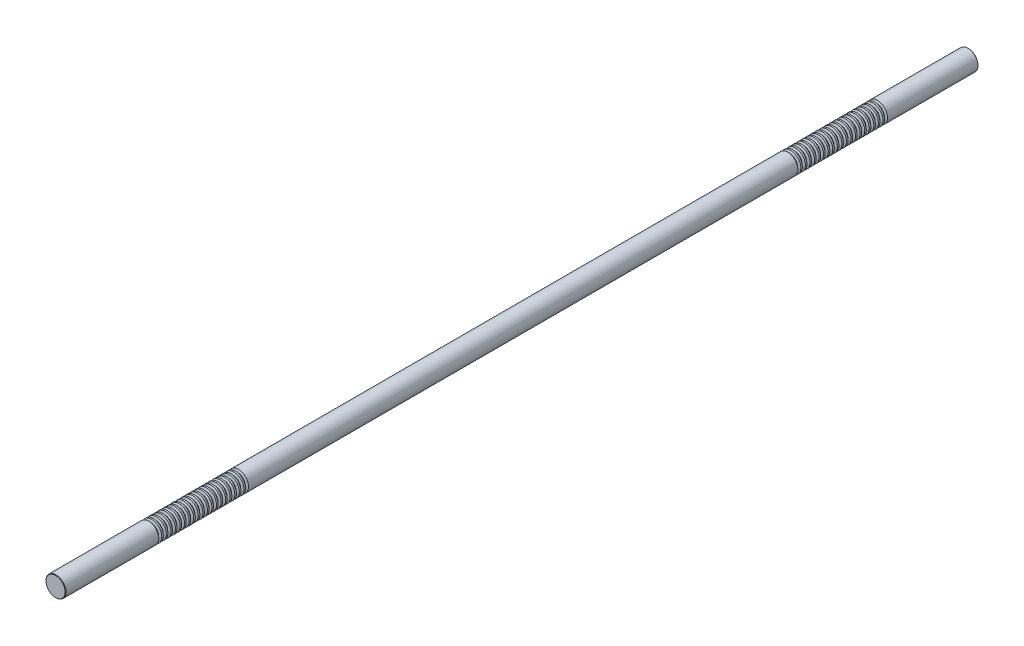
from build123d import *

# Parameters (mm, degrees)
SKETCH1_R           = 11
BOSS_EXTRUDE1_DEPTH = 500
CHAMFER1_SIZE       = 0.55
LPATTERN1_COUNT     = 20
LPATTERN1_PITCH     = 5
LPATTERN2_COUNT     = 2
LPATTERN2_PITCH     = 700


with BuildPart() as part:
    # Sketch1 → Boss-Extrude1 (new, symmetric)
    with BuildSketch(Plane.XY):
        Circle(SKETCH1_R)
    extrude(amount=BOSS_EXTRUDE1_DEPTH, both=True)

    # Chamfer1
    chamfer1_edges = [part.edges().sort_by_distance(p)[0] for p in [
        (-11, 0, -500),
        (-11, 0, 500),
    ]]
    chamfer(chamfer1_edges, length=CHAMFER1_SIZE)

    # Sketch2 → Cut-Revolve1 (revolve, cut)
    with BuildSketch(Plane(origin=(0, 0, 0), x_dir=(0, 0, -1), z_dir=(1, 0, 0)), mode=Mode.PRIVATE) as cut_revolve1_sk:
        Polygon((400.36843014, 11), (397.13156986, 11), (397.86843014, 8.25), (399.63156986, 8.25), align=None)
    cut_revolve1 = revolve(cut_revolve1_sk.sketch.rotate(Axis((0, 0, 500), (0, 0, -1)), 90), axis=Axis((0, 0, 500), (0, 0, -1)), mode=Mode.SUBTRACT)

    # LPattern1: Cut-Revolve1 ×20
    with Locations(*[(0, 0, i * LPATTERN1_PITCH) for i in range(1, LPATTERN1_COUNT)]):
        add(cut_revolve1, mode=Mode.SUBTRACT)

    # LPattern2: Cut-Revolve1 ×2
    with Locations(*[(0, 0, i * LPATTERN2_PITCH) for i in range(1, LPATTERN2_COUNT)]):
        add(cut_revolve1, mode=Mode.SUBTRACT)

    # LPattern2 copy 1 sketch → LPattern2 copy 1 (revolve, cut)
    with BuildSketch(Plane(origin=(0, 0, 705), x_dir=(0, 0, -1), z_dir=(1, 0, 0))):
        Polygon((400.36843014, 11), (397.13156986, 11), (397.86843014, 8.25), (399.63156986, 8.25), align=None)
    revolve(axis=Axis((0, 0, 1205), (0, 0, -1)), mode=Mode.SUBTRACT)

    # LPattern2 copy 2 sketch → LPattern2 copy 2 (revolve, cut)
    with BuildSketch(Plane(origin=(0, 0, 710), x_dir=(0, 0, -1), z_dir=(1, 0, 0))):
        Polygon((400.36843014, 11), (397.13156986, 11), (397.86843014, 8.25), (399.63156986, 8.25), align=None)
    revolve(axis=Axis((0, 0, 1210), (0, 0, -1)), mode=Mode.SUBTRACT)

    # LPattern2 copy 3 sketch → LPattern2 copy 3 (revolve, cut)
    with BuildSketch(Plane(origin=(0, 0, 715), x_dir=(0, 0, -1), z_dir=(1, 0, 0))):
        Polygon((400.36843014, 11), (397.13156986, 11), (397.86843014, 8.25), (399.63156986, 8.25), align=None)
    revolve(axis=Axis((0, 0, 1215), (0, 0, -1)), mode=Mode.SUBTRACT)

    # LPattern2 copy 4 sketch → LPattern2 copy 4 (revolve, cut)
    with BuildSketch(Plane(origin=(0, 0, 720), x_dir=(0, 0, -1), z_dir=(1, 0, 0))):
        Polygon((400.36843014, 11), (397.13156986, 11), (397.86843014, 8.25), (399.63156986, 8.25), align=None)
    revolve(axis=Axis((0, 0, 1220), (0, 0, -1)), mode=Mode.SUBTRACT)

    # LPattern2 copy 5 sketch → LPattern2 copy 5 (revolve, cut)
    with BuildSketch(Plane(origin=(0, 0, 725), x_dir=(0, 0, -1), z_dir=(1, 0, 0))):
        Polygon((400.36843014, 11), (397.13156986, 11), (397.86843014, 8.25), (399.63156986, 8.25), align=None)
    revolve(axis=Axis((0, 0, 1225), (0, 0, -1)), mode=Mode.SUBTRACT)

    # LPattern2 copy 6 sketch → LPattern2 copy 6 (revolve, cut)
    with BuildSketch(Plane(origin=(0, 0, 730), x_dir=(0, 0, -1), z_dir=(1, 0, 0))):
        Polygon((400.36843014, 11), (397.13156986, 11), (397.86843014, 8.25), (399.63156986, 8.25), align=None)
    revolve(axis=Axis((0, 0, 1230), (0, 0, -1)), mode=Mode.SUBTRACT)

    # LPattern2 copy 7 sketch → LPattern2 copy 7 (revolve, cut)
    with BuildSketch(Plane(origin=(0, 0, 735), x_dir=(0, 0, -1), z_dir=(1, 0, 0))):
        Polygon((400.36843014, 11), (397.13156986, 11), (397.86843014, 8.25), (399.63156986, 8.25), align=None)
    revolve(axis=Axis((0, 0, 1235), (0, 0, -1)), mode=Mode.SUBTRACT)

    # LPattern2 copy 8 sketch → LPattern2 copy 8 (revolve, cut)
    with BuildSketch(Plane(origin=(0, 0, 740), x_dir=(0, 0, -1), z_dir=(1, 0, 0))):
        Polygon((400.36843014, 11), (397.13156986, 11), (397.86843014, 8.25), (399.63156986, 8.25), align=None)
    revolve(axis=Axis((0, 0, 1240), (0, 0, -1)), mode=Mode.SUBTRACT)

    # LPattern2 copy 9 sketch → LPattern2 copy 9 (revolve, cut)
    with BuildSketch(Plane(origin=(0, 0, 745), x_dir=(0, 0, -1), z_dir=(1, 0, 0))):
        Polygon((400.36843014, 11), (397.13156986, 11), (397.86843014, 8.25), (399.63156986, 8.25), align=None)
    revolve(axis=Axis((0, 0, 1245), (0, 0, -1)), mode=Mode.SUBTRACT)

    # LPattern2 copy 10 sketch → LPattern2 copy 10 (revolve, cut)
    with BuildSketch(Plane(origin=(0, 0, 750), x_dir=(0, 0, -1), z_dir=(1, 0, 0))):
        Polygon((400.36843014, 11), (397.13156986, 11), (397.86843014, 8.25), (399.63156986, 8.25), align=None)
    revolve(axis=Axis((0, 0, 1250), (0, 0, -1)), mode=Mode.SUBTRACT)

    # LPattern2 copy 11 sketch → LPattern2 copy 11 (revolve, cut)
    with BuildSketch(Plane(origin=(0, 0, 755), x_dir=(0, 0, -1), z_dir=(1, 0, 0))):
        Polygon((400.36843014, 11), (397.13156986, 11), (397.86843014, 8.25), (399.63156986, 8.25), align=None)
    revolve(axis=Axis((0, 0, 1255), (0, 0, -1)), mode=Mode.SUBTRACT)

    # LPattern2 copy 12 sketch → LPattern2 copy 12 (revolve, cut)
    with BuildSketch(Plane(origin=(0, 0, 760), x_dir=(0, 0, -1), z_dir=(1, 0, 0))):
        Polygon((400.36843014, 11), (397.13156986, 11), (397.86843014, 8.25), (399.63156986, 8.25), align=None)
    revolve(axis=Axis((0, 0, 1260), (0, 0, -1)), mode=Mode.SUBTRACT)

    # LPattern2 copy 13 sketch → LPattern2 copy 13 (revolve, cut)
    with BuildSketch(Plane(origin=(0, 0, 765), x_dir=(0, 0, -1), z_dir=(1, 0, 0))):
        Polygon((400.36843014, 11), (397.13156986, 11), (397.86843014, 8.25), (399.63156986, 8.25), align=None)
    revolve(axis=Axis((0, 0, 1265), (0, 0, -1)), mode=Mode.SUBTRACT)

    # LPattern2 copy 14 sketch → LPattern2 copy 14 (revolve, cut)
    with BuildSketch(Plane(origin=(0, 0, 770), x_dir=(0, 0, -1), z_dir=(1, 0, 0))):
        Polygon((400.36843014, 11), (397.13156986, 11), (397.86843014, 8.25), (399.63156986, 8.25), align=None)
    revolve(axis=Axis((0, 0, 1270), (0, 0, -1)), mode=Mode.SUBTRACT)

    # LPattern2 copy 15 sketch → LPattern2 copy 15 (revolve, cut)
    with BuildSketch(Plane(origin=(0, 0, 775), x_dir=(0, 0, -1), z_dir=(1, 0, 0))):
        Polygon((400.36843014, 11), (397.13156986, 11), (397.86843014, 8.25), (399.63156986, 8.25), align=None)
    revolve(axis=Axis((0, 0, 1275), (0, 0, -1)), mode=Mode.SUBTRACT)

    # LPattern2 copy 16 sketch → LPattern2 copy 16 (revolve, cut)
    with BuildSketch(Plane(origin=(0, 0, 780), x_dir=(0, 0, -1), z_dir=(1, 0, 0))):
        Polygon((400.36843014, 11), (397.13156986, 11), (397.86843014, 8.25), (399.63156986, 8.25), align=None)
    revolve(axis=Axis((0, 0, 1280), (0, 0, -1)), mode=Mode.SUBTRACT)

    # LPattern2 copy 17 sketch → LPattern2 copy 17 (revolve, cut)
    with BuildSketch(Plane(origin=(0, 0, 785), x_dir=(0, 0, -1), z_dir=(1, 0, 0))):
        Polygon((400.36843014, 11), (397.13156986, 11), (397.86843014, 8.25), (399.63156986, 8.25), align=None)
    revolve(axis=Axis((0, 0, 1285), (0, 0, -1)), mode=Mode.SUBTRACT)

    # LPattern2 copy 18 sketch → LPattern2 copy 18 (revolve, cut)
    with BuildSketch(Plane(origin=(0, 0, 790), x_dir=(0, 0, -1), z_dir=(1, 0, 0))):
        Polygon((400.36843014, 11), (397.13156986, 11), (397.86843014, 8.25), (399.63156986, 8.25), align=None)
    revolve(axis=Axis((0, 0, 1290), (0, 0, -1)), mode=Mode.SUBTRACT)

    # LPattern2 copy 19 sketch → LPattern2 copy 19 (revolve, cut)
    with BuildSketch(Plane(origin=(0, 0, 795), x_dir=(0, 0, -1), z_dir=(1, 0, 0))):
        Polygon((400.36843014, 11), (397.13156986, 11), (397.86843014, 8.25), (399.63156986, 8.25), align=None)
    revolve(axis=Axis((0, 0, 1295), (0, 0, -1)), mode=Mode.SUBTRACT)


solid = part.part
